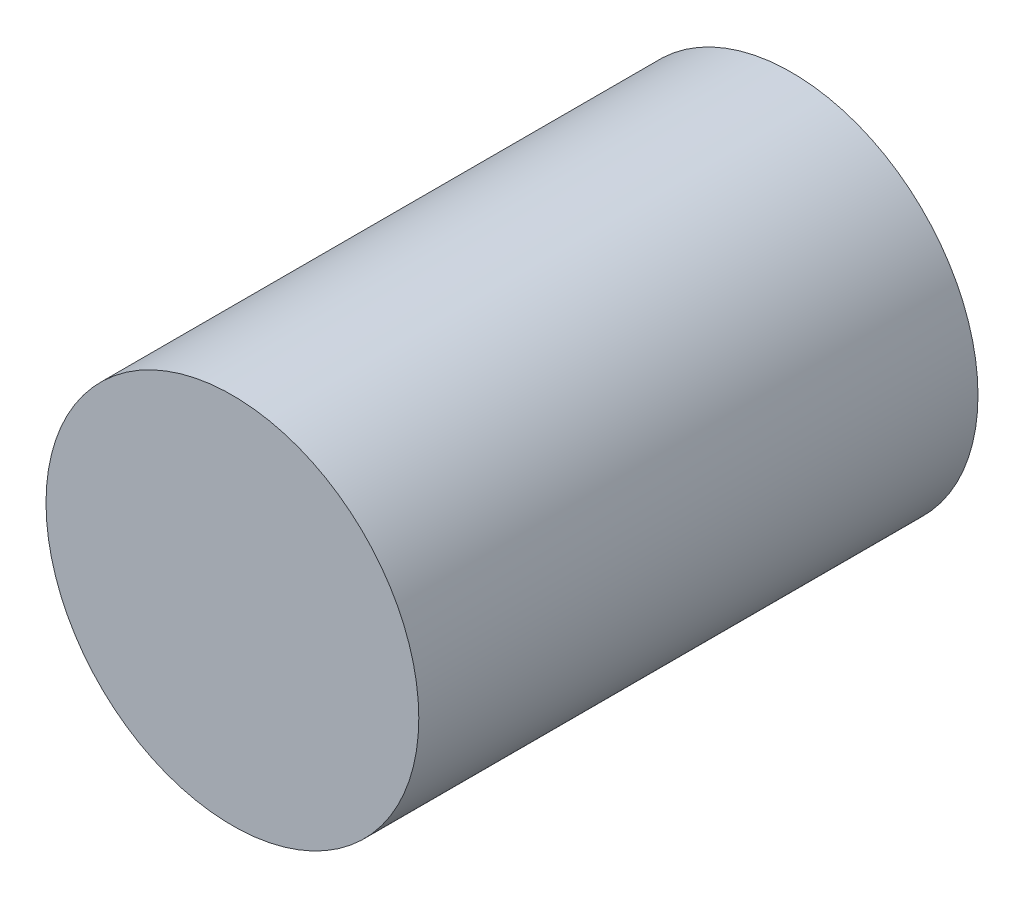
ISO-10303-21;
HEADER;
FILE_DESCRIPTION(('STEP AP214'),'2;1');
FILE_NAME('part.step','',(''),(''),'','','');
FILE_SCHEMA(('AUTOMOTIVE_DESIGN { 1 0 10303 214 1 1 1 1 }'));
ENDSEC;
DATA;
#1=APPLICATION_CONTEXT('core data for automotive mechanical design processes');
#2=APPLICATION_PROTOCOL_DEFINITION('international standard','automotive_design',2000,#1);
#3=PRODUCT_CONTEXT('',#1,'mechanical');
#4=PRODUCT('Part','Part','',(#3));
#5=PRODUCT_RELATED_PRODUCT_CATEGORY('part','',(#4));
#6=PRODUCT_DEFINITION_FORMATION('','',#4);
#7=PRODUCT_DEFINITION_CONTEXT('part definition',#1,'design');
#8=PRODUCT_DEFINITION('design','',#6,#7);
#9=PRODUCT_DEFINITION_SHAPE('','',#8);
#10=(LENGTH_UNIT() NAMED_UNIT(*) SI_UNIT(.MILLI.,.METRE.));
#11=(NAMED_UNIT(*) PLANE_ANGLE_UNIT() SI_UNIT($,.RADIAN.));
#12=(NAMED_UNIT(*) SI_UNIT($,.STERADIAN.) SOLID_ANGLE_UNIT());
#13=UNCERTAINTY_MEASURE_WITH_UNIT(LENGTH_MEASURE(1.E-05),#10,'distance_accuracy_value','');
#14=(GEOMETRIC_REPRESENTATION_CONTEXT(3) GLOBAL_UNCERTAINTY_ASSIGNED_CONTEXT((#13)) GLOBAL_UNIT_ASSIGNED_CONTEXT((#10,
#11,#12)) REPRESENTATION_CONTEXT('',''));
#15=CARTESIAN_POINT('',(0.,0.,0.));
#16=DIRECTION('',(0.,0.,1.));
#17=DIRECTION('',(1.,0.,0.));
#18=AXIS2_PLACEMENT_3D('',#15,#16,#17);
#19=CARTESIAN_POINT('',(0.,0.,3.00000000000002));
#20=DIRECTION('',(0.,0.,-0.999999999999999));
#21=DIRECTION('',(-1.,0.,0.));
#22=AXIS2_PLACEMENT_3D('',#19,#20,#21);
#23=CYLINDRICAL_SURFACE('',#22,1.);
#24=CARTESIAN_POINT('',(0.,0.,3.00000000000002));
#25=DIRECTION('',(0.,0.,0.999999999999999));
#26=DIRECTION('',(1.,0.,0.));
#27=AXIS2_PLACEMENT_3D('',#24,#25,#26);
#28=CIRCLE('',#27,1.);
#29=CARTESIAN_POINT('',(-1.00000000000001,0.,3.00000000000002));
#30=VERTEX_POINT('',#29);
#31=EDGE_CURVE('E10',#30,#30,#28,.T.);
#32=CARTESIAN_POINT('',(0.,0.,0.));
#33=DIRECTION('',(0.,0.,0.999999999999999));
#34=DIRECTION('',(1.,0.,0.));
#35=AXIS2_PLACEMENT_3D('',#32,#33,#34);
#36=CIRCLE('',#35,1.);
#37=CARTESIAN_POINT('',(-1.00000000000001,0.,0.));
#38=VERTEX_POINT('',#37);
#39=EDGE_CURVE('E34',#38,#38,#36,.T.);
#40=CARTESIAN_POINT('',(-1.00000000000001,0.,3.00000000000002));
#41=CARTESIAN_POINT('',(-1.00000000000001,0.,2.96875000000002));
#42=CARTESIAN_POINT('',(-1.00000000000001,0.,2.93750000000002));
#43=CARTESIAN_POINT('',(-1.00000000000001,0.,2.87500000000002));
#44=CARTESIAN_POINT('',(-1.00000000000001,0.,2.84375000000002));
#45=CARTESIAN_POINT('',(-1.00000000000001,0.,2.78125000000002));
#46=CARTESIAN_POINT('',(-1.00000000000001,0.,2.75000000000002));
#47=CARTESIAN_POINT('',(-1.00000000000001,0.,2.68750000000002));
#48=CARTESIAN_POINT('',(-1.00000000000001,0.,2.65625000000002));
#49=CARTESIAN_POINT('',(-1.00000000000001,0.,2.59375000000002));
#50=CARTESIAN_POINT('',(-1.00000000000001,0.,2.56250000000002));
#51=CARTESIAN_POINT('',(-1.00000000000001,0.,2.50000000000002));
#52=CARTESIAN_POINT('',(-1.00000000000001,0.,2.46875000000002));
#53=CARTESIAN_POINT('',(-1.00000000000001,0.,2.40625000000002));
#54=CARTESIAN_POINT('',(-1.00000000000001,0.,2.37500000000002));
#55=CARTESIAN_POINT('',(-1.00000000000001,0.,2.31250000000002));
#56=CARTESIAN_POINT('',(-1.00000000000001,0.,2.28125000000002));
#57=CARTESIAN_POINT('',(-1.00000000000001,0.,2.21875000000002));
#58=CARTESIAN_POINT('',(-1.00000000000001,0.,2.18750000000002));
#59=CARTESIAN_POINT('',(-1.00000000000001,0.,2.12500000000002));
#60=CARTESIAN_POINT('',(-1.00000000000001,0.,2.09375000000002));
#61=CARTESIAN_POINT('',(-1.00000000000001,0.,2.03125000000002));
#62=CARTESIAN_POINT('',(-1.00000000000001,0.,2.00000000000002));
#63=CARTESIAN_POINT('',(-1.00000000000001,0.,1.93750000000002));
#64=CARTESIAN_POINT('',(-1.00000000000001,0.,1.90625000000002));
#65=CARTESIAN_POINT('',(-1.00000000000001,0.,1.84375000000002));
#66=CARTESIAN_POINT('',(-1.00000000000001,0.,1.81250000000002));
#67=CARTESIAN_POINT('',(-1.00000000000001,0.,1.75000000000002));
#68=CARTESIAN_POINT('',(-1.00000000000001,0.,1.71875000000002));
#69=CARTESIAN_POINT('',(-1.00000000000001,0.,1.65625000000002));
#70=CARTESIAN_POINT('',(-1.00000000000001,0.,1.62500000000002));
#71=CARTESIAN_POINT('',(-1.00000000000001,0.,1.56250000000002));
#72=CARTESIAN_POINT('',(-1.00000000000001,0.,1.53125000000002));
#73=CARTESIAN_POINT('',(-1.00000000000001,0.,1.46875000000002));
#74=CARTESIAN_POINT('',(-1.00000000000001,0.,1.43750000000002));
#75=CARTESIAN_POINT('',(-1.00000000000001,0.,1.37500000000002));
#76=CARTESIAN_POINT('',(-1.00000000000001,0.,1.34375000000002));
#77=CARTESIAN_POINT('',(-1.00000000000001,0.,1.28125000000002));
#78=CARTESIAN_POINT('',(-1.00000000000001,0.,1.25000000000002));
#79=CARTESIAN_POINT('',(-1.00000000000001,0.,1.18750000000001));
#80=CARTESIAN_POINT('',(-1.00000000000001,0.,1.15625000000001));
#81=CARTESIAN_POINT('',(-1.00000000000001,0.,1.09375000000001));
#82=CARTESIAN_POINT('',(-1.00000000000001,0.,1.06250000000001));
#83=CARTESIAN_POINT('',(-1.00000000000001,0.,1.00000000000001));
#84=CARTESIAN_POINT('',(-1.00000000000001,0.,0.968750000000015));
#85=CARTESIAN_POINT('',(-1.00000000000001,0.,0.906250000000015));
#86=CARTESIAN_POINT('',(-1.00000000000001,0.,0.875000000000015));
#87=CARTESIAN_POINT('',(-1.00000000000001,0.,0.812500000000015));
#88=CARTESIAN_POINT('',(-1.00000000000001,0.,0.781250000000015));
#89=CARTESIAN_POINT('',(-1.00000000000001,0.,0.718750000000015));
#90=CARTESIAN_POINT('',(-1.00000000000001,0.,0.687500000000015));
#91=CARTESIAN_POINT('',(-1.00000000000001,0.,0.625000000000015));
#92=CARTESIAN_POINT('',(-1.00000000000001,0.,0.593750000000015));
#93=CARTESIAN_POINT('',(-1.00000000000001,0.,0.531250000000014));
#94=CARTESIAN_POINT('',(-1.00000000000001,0.,0.500000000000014));
#95=CARTESIAN_POINT('',(-1.00000000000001,0.,0.437500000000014));
#96=CARTESIAN_POINT('',(-1.00000000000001,0.,0.406250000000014));
#97=CARTESIAN_POINT('',(-1.00000000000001,0.,0.343750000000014));
#98=CARTESIAN_POINT('',(-1.00000000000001,0.,0.312500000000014));
#99=CARTESIAN_POINT('',(-1.00000000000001,0.,0.250000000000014));
#100=CARTESIAN_POINT('',(-1.00000000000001,0.,0.218750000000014));
#101=CARTESIAN_POINT('',(-1.00000000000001,0.,0.156250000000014));
#102=CARTESIAN_POINT('',(-1.00000000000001,0.,0.125000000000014));
#103=CARTESIAN_POINT('',(-1.00000000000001,0.,0.0625000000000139));
#104=CARTESIAN_POINT('',(-1.00000000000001,0.,0.0312500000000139));
#105=CARTESIAN_POINT('',(-1.00000000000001,0.,0.));
#106=B_SPLINE_CURVE_WITH_KNOTS('',3,(#40,#41,#42,#43,#44,#45,#46,#47,#48,#49,#50,#51,#52,#53,
#54,#55,#56,#57,#58,#59,#60,#61,#62,#63,#64,#65,#66,#67,#68,#69,#70,#71,#72,#73,#74,#75,#76,#77,
#78,#79,#80,#81,#82,#83,#84,#85,#86,#87,#88,#89,#90,#91,#92,#93,#94,#95,#96,#97,#98,#99,#100,
#101,#102,#103,#104,#105),.UNSPECIFIED.,.F.,.F.,(4,2,2,2,2,2,2,2,2,2,2,2,2,2,2,2,2,2,2,2,2,2,2,
2,2,2,2,2,2,2,2,2,4),(0.,0.0937500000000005,0.187500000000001,0.281250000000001,
0.375000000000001,0.468750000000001,0.562500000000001,0.656250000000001,0.750000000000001,
0.843750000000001,0.937500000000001,1.03125,1.125,1.21875,1.3125,1.40625,1.5,1.59375,1.6875,
1.78125,1.875,1.96875,2.0625,2.15625,2.25,2.34375,2.4375,2.53125,2.625,2.71875,2.8125,2.90625,
3.),.UNSPECIFIED.);
#107=EDGE_CURVE('BSEAM28',#30,#38,#106,.T.);
#108=ORIENTED_EDGE('',*,*,#31,.F.);
#109=ORIENTED_EDGE('',*,*,#39,.T.);
#110=ORIENTED_EDGE('',*,*,#107,.T.);
#111=ORIENTED_EDGE('',*,*,#107,.F.);
#112=EDGE_LOOP('',(#108,#110,#109,#111));
#113=FACE_BOUND('',#112,.T.);
#114=ADVANCED_FACE('F28',(#113),#23,.T.);
#115=CARTESIAN_POINT('',(0.,0.,3.00000000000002));
#116=DIRECTION('',(0.,0.,0.999999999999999));
#117=DIRECTION('',(1.,0.,0.));
#118=AXIS2_PLACEMENT_3D('',#115,#116,#117);
#119=PLANE('',#118);
#120=ORIENTED_EDGE('',*,*,#31,.T.);
#121=EDGE_LOOP('',(#120));
#122=FACE_BOUND('',#121,.T.);
#123=ADVANCED_FACE('F43',(#122),#119,.T.);
#124=CARTESIAN_POINT('',(0.,0.,0.));
#125=DIRECTION('',(0.,0.,0.999999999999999));
#126=DIRECTION('',(1.,0.,0.));
#127=AXIS2_PLACEMENT_3D('',#124,#125,#126);
#128=PLANE('',#127);
#129=ORIENTED_EDGE('',*,*,#39,.F.);
#130=EDGE_LOOP('',(#129));
#131=FACE_BOUND('',#130,.T.);
#132=ADVANCED_FACE('F41',(#131),#128,.F.);
#133=CLOSED_SHELL('',(#114,#123,#132));
#134=MANIFOLD_SOLID_BREP('B2',#133);
#135=ADVANCED_BREP_SHAPE_REPRESENTATION('',(#18,#134),#14);
#136=SHAPE_DEFINITION_REPRESENTATION(#9,#135);
ENDSEC;
END-ISO-10303-21;
